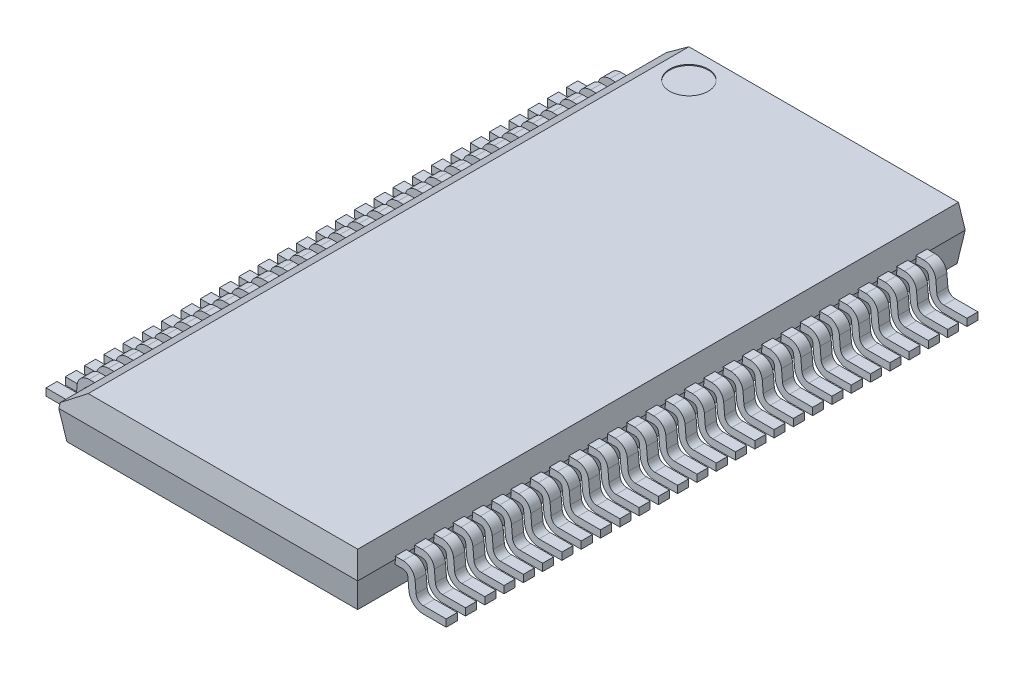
from build123d import *

# Parameters (mm, degrees)
EXTRUDE_1_DEPTH               = 0.115
SKETCH_19245_W                = 6.2
SKETCH_19245_H                = 12.6
EXTRUDE_19303_DEPTH           = 0.5
EXTRUDE_19303_TAPER           = 8
EXTRUDE_19303_OTHER_WAY_DEPTH = 0.6
EXTRUDE_19303_OTHER_WAY_TAPER = 8
PATTERN_LINEAR_19382_COUNT    = 28
PATTERN_LINEAR_19382_PITCH    = 0.4
CHAMFER_1_SIZE                = 0.4
CHAMFER_1_SIZE2               = 0.469982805
SKETCH_3_R                    = 0.4
CUT_EXTRUDE_3_DEPTH           = 0.02
SKTHERMALPAD_W                = 5.2
SKTHERMALPAD_H                = 11.6
THERMALPAD_DEPTH              = 0.7


with BuildPart() as part:
    # Sketch 1 → Extrude 1 (new, symmetric)
    with BuildSketch(Plane.XY.offset(-5.4)):
        with BuildLine():
            Line((-4.15, 0), (-3.674899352, 0))
            ThreePointArc((-3.674899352, 0), (-3.47222229, 0.078816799), (-3.376040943, 0.273853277))
            Line((-3.376040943, 0.273853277), (-3.355493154, 0.508715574))
            ThreePointArc((-3.355493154, 0.508715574), (-3.323432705, 0.573727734), (-3.255873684, 0.6))
            Line((-3.255873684, 0.6), (3.255873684, 0.6))
            ThreePointArc((3.255873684, 0.6), (3.323432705, 0.573727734), (3.355493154, 0.508715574))
            Line((3.355493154, 0.508715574), (3.376040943, 0.273853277))
            ThreePointArc((3.376040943, 0.273853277), (3.47222229, 0.078816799), (3.674899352, 0))
            Line((3.674899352, 0), (4.15, 0))
            Line((4.15, 0), (4.15, 0.15))
            Line((4.15, 0.15), (3.674899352, 0.15))
            ThreePointArc((3.674899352, 0.15), (3.573560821, 0.189408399), (3.525470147, 0.286926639))
            Line((3.525470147, 0.286926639), (3.504922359, 0.521788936))
            ThreePointArc((3.504922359, 0.521788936), (3.424771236, 0.684319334), (3.255873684, 0.75))
            Line((3.255873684, 0.75), (-3.255873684, 0.75))
            ThreePointArc((-3.255873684, 0.75), (-3.424771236, 0.684319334), (-3.504922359, 0.521788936))
            Line((-3.504922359, 0.521788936), (-3.525470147, 0.286926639))
            ThreePointArc((-3.525470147, 0.286926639), (-3.573560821, 0.189408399), (-3.674899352, 0.15))
            Line((-3.674899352, 0.15), (-4.15, 0.15))
            Line((-4.15, 0.15), (-4.15, 0))
        make_face()
    extrude_1 = extrude(amount=EXTRUDE_1_DEPTH, both=True)

    # Sketch 19245 → Extrude 19303 (add)
    with BuildSketch(Plane(origin=(0, 0.7, 0), x_dir=(1, 0, 0), z_dir=(0, 1, 0))):
        Rectangle(SKETCH_19245_W, SKETCH_19245_H)
    extrude(amount=EXTRUDE_19303_DEPTH, taper=EXTRUDE_19303_TAPER)

    # Sketch 19245 → Extrude 19303 other way (add)
    with BuildSketch(Plane(origin=(0, 0.7, 0), x_dir=(1, 0, 0), z_dir=(0, 1, 0))):
        Rectangle(SKETCH_19245_W, SKETCH_19245_H)
    extrude(amount=-EXTRUDE_19303_OTHER_WAY_DEPTH, taper=EXTRUDE_19303_OTHER_WAY_TAPER)

    # Pattern Linear 19382: Extrude 1 ×28
    with Locations(*[(0, 0, i * PATTERN_LINEAR_19382_PITCH) for i in range(1, PATTERN_LINEAR_19382_COUNT)]):
        add(extrude_1)

    # Chamfer 1
    chamfer_1_edges = [part.edges().sort_by_distance(p)[0] for p in [
        (-3.029729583, 1.2, 0),
    ]]
    chamfer_1_side = [part.faces().sort_by_distance(p)[0] for p in [
        (-3.063220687, 0.961698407, 0),
    ]]
    chamfer(chamfer_1_edges, length=CHAMFER_1_SIZE, length2=CHAMFER_1_SIZE2, reference=chamfer_1_side[0])

    # Sketch 3 → Cut-Extrude 3 (cut)
    with BuildSketch(Plane(origin=(0, 1.2, 0), x_dir=(1, 0, 0), z_dir=(0, 1, 0))):
        with Locations(Location((-1.959746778, 5.629729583, 0), (0, 0, 270))):
            Circle(SKETCH_3_R)
    extrude(amount=-CUT_EXTRUDE_3_DEPTH, mode=Mode.SUBTRACT)

    # SkThermalPad → ThermalPad (add)
    with BuildSketch(Plane(origin=(0, 0.7, 0), x_dir=(-1, 0, 0), z_dir=(0, 1, 0))):
        Rectangle(SKTHERMALPAD_W, SKTHERMALPAD_H)
    extrude(amount=-THERMALPAD_DEPTH)


solid = part.part
